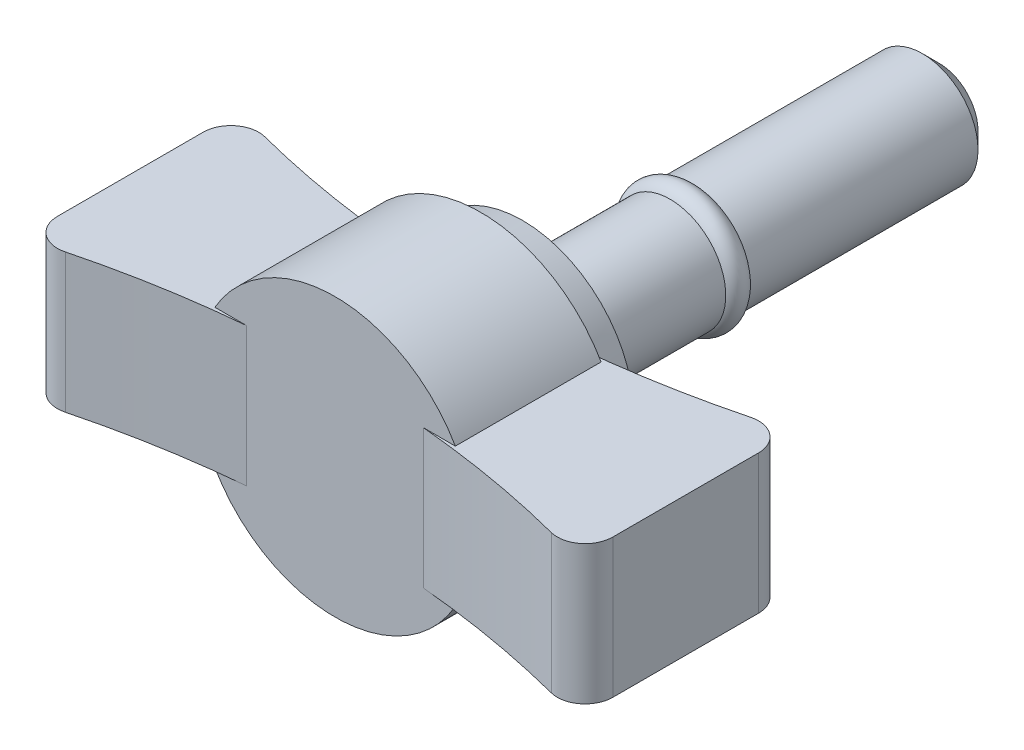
ISO-10303-21;
HEADER;
FILE_DESCRIPTION(('STEP AP214'),'2;1');
FILE_NAME('part.step','',(''),(''),'','','');
FILE_SCHEMA(('AUTOMOTIVE_DESIGN { 1 0 10303 214 1 1 1 1 }'));
ENDSEC;
DATA;
#1=APPLICATION_CONTEXT('core data for automotive mechanical design processes');
#2=APPLICATION_PROTOCOL_DEFINITION('international standard','automotive_design',2000,#1);
#3=PRODUCT_CONTEXT('',#1,'mechanical');
#4=PRODUCT('Part','Part','',(#3));
#5=PRODUCT_RELATED_PRODUCT_CATEGORY('part','',(#4));
#6=PRODUCT_DEFINITION_FORMATION('','',#4);
#7=PRODUCT_DEFINITION_CONTEXT('part definition',#1,'design');
#8=PRODUCT_DEFINITION('design','',#6,#7);
#9=PRODUCT_DEFINITION_SHAPE('','',#8);
#10=(LENGTH_UNIT() NAMED_UNIT(*) SI_UNIT(.MILLI.,.METRE.));
#11=(NAMED_UNIT(*) PLANE_ANGLE_UNIT() SI_UNIT($,.RADIAN.));
#12=(NAMED_UNIT(*) SI_UNIT($,.STERADIAN.) SOLID_ANGLE_UNIT());
#13=UNCERTAINTY_MEASURE_WITH_UNIT(LENGTH_MEASURE(1.E-05),#10,'distance_accuracy_value','');
#14=(GEOMETRIC_REPRESENTATION_CONTEXT(3) GLOBAL_UNCERTAINTY_ASSIGNED_CONTEXT((#13)) GLOBAL_UNIT_ASSIGNED_CONTEXT((#10,
#11,#12)) REPRESENTATION_CONTEXT('',''));
#15=CARTESIAN_POINT('',(0.,0.,0.));
#16=DIRECTION('',(0.,0.,1.));
#17=DIRECTION('',(1.,0.,0.));
#18=AXIS2_PLACEMENT_3D('',#15,#16,#17);
#19=CARTESIAN_POINT('',(0.,0.,3.));
#20=DIRECTION('',(0.,0.,1.));
#21=DIRECTION('',(1.,0.,0.));
#22=AXIS2_PLACEMENT_3D('',#19,#20,#21);
#23=PLANE('',#22);
#24=DIRECTION('',(-1.,0.,0.));
#25=VECTOR('',#24,1.);
#26=CARTESIAN_POINT('',(0.,-5.,3.));
#27=LINE('',#26,#25);
#28=CARTESIAN_POINT('',(8.66025403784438,-5.,3.));
#29=VERTEX_POINT('',#28);
#30=CARTESIAN_POINT('',(6.84311506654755,-5.,3.));
#31=VERTEX_POINT('',#30);
#32=EDGE_CURVE('E220',#29,#31,#27,.T.);
#33=ORIENTED_EDGE('',*,*,#32,.F.);
#34=CARTESIAN_POINT('',(0.,0.,3.));
#35=DIRECTION('',(0.,0.,1.));
#36=DIRECTION('',(1.,0.,0.));
#37=AXIS2_PLACEMENT_3D('',#34,#35,#36);
#38=CIRCLE('',#37,10.);
#39=CARTESIAN_POINT('',(-8.66025403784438,-5.,3.));
#40=VERTEX_POINT('',#39);
#41=EDGE_CURVE('E272',#40,#29,#38,.T.);
#42=ORIENTED_EDGE('',*,*,#41,.F.);
#43=CARTESIAN_POINT('',(-6.84311506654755,-5.,3.));
#44=VERTEX_POINT('',#43);
#45=EDGE_CURVE('E217',#44,#40,#27,.T.);
#46=ORIENTED_EDGE('',*,*,#45,.F.);
#47=CARTESIAN_POINT('',(0.,0.,3.));
#48=DIRECTION('',(0.,0.,1.));
#49=DIRECTION('',(1.,0.,0.));
#50=AXIS2_PLACEMENT_3D('',#47,#48,#49);
#51=CIRCLE('',#50,8.47515332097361);
#52=EDGE_CURVE('E283',#44,#31,#51,.T.);
#53=ORIENTED_EDGE('',*,*,#52,.T.);
#54=EDGE_LOOP('',(#33,#42,#46,#53));
#55=FACE_BOUND('',#54,.T.);
#56=ADVANCED_FACE('F14',(#55),#23,.F.);
#57=CARTESIAN_POINT('',(0.,0.,13.5));
#58=DIRECTION('',(0.,0.,-1.));
#59=DIRECTION('',(-1.,0.,0.));
#60=AXIS2_PLACEMENT_3D('',#57,#58,#59);
#61=CYLINDRICAL_SURFACE('',#60,10.);
#62=DIRECTION('',(0.,0.,-1.));
#63=VECTOR('',#62,1.);
#64=CARTESIAN_POINT('',(8.66025403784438,-5.,13.5));
#65=LINE('',#64,#63);
#66=CARTESIAN_POINT('',(8.66025403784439,-5.,13.5));
#67=VERTEX_POINT('',#66);
#68=EDGE_CURVE('E228',#67,#29,#65,.T.);
#69=ORIENTED_EDGE('',*,*,#68,.F.);
#70=CARTESIAN_POINT('',(0.,0.,13.5));
#71=DIRECTION('',(0.,0.,1.));
#72=DIRECTION('',(1.,0.,0.));
#73=AXIS2_PLACEMENT_3D('',#70,#71,#72);
#74=CIRCLE('',#73,10.);
#75=CARTESIAN_POINT('',(-8.66025403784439,-5.,13.5));
#76=VERTEX_POINT('',#75);
#77=EDGE_CURVE('E276',#76,#67,#74,.T.);
#78=ORIENTED_EDGE('',*,*,#77,.F.);
#79=DIRECTION('',(0.,0.,-1.));
#80=VECTOR('',#79,1.);
#81=CARTESIAN_POINT('',(-8.66025403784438,-5.,13.5));
#82=LINE('',#81,#80);
#83=EDGE_CURVE('E37',#40,#76,#82,.F.);
#84=ORIENTED_EDGE('',*,*,#83,.F.);
#85=ORIENTED_EDGE('',*,*,#41,.T.);
#86=EDGE_LOOP('',(#69,#78,#84,#85));
#87=FACE_BOUND('',#86,.T.);
#88=ADVANCED_FACE('F348',(#87),#61,.T.);
#89=CARTESIAN_POINT('',(0.,0.,-50.));
#90=DIRECTION('',(0.,0.,-1.));
#91=DIRECTION('',(-1.,0.,0.));
#92=AXIS2_PLACEMENT_3D('',#89,#90,#91);
#93=CYLINDRICAL_SURFACE('',#92,4.);
#94=CARTESIAN_POINT('',(0.,0.,-10.6339745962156));
#95=DIRECTION('',(0.,0.,-1.));
#96=DIRECTION('',(-1.,0.,0.));
#97=AXIS2_PLACEMENT_3D('',#94,#95,#96);
#98=CIRCLE('',#97,4.);
#99=CARTESIAN_POINT('',(-4.,0.,-10.6339745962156));
#100=VERTEX_POINT('',#99);
#101=EDGE_CURVE('E293',#100,#100,#98,.T.);
#102=ORIENTED_EDGE('',*,*,#101,.F.);
#103=EDGE_LOOP('',(#102));
#104=FACE_BOUND('',#103,.T.);
#105=CARTESIAN_POINT('',(0.,0.,0.));
#106=DIRECTION('',(0.,0.,-1.));
#107=DIRECTION('',(-1.,0.,0.));
#108=AXIS2_PLACEMENT_3D('',#105,#106,#107);
#109=CIRCLE('',#108,4.);
#110=CARTESIAN_POINT('',(-4.,0.,0.));
#111=VERTEX_POINT('',#110);
#112=EDGE_CURVE('E287',#111,#111,#109,.T.);
#113=ORIENTED_EDGE('',*,*,#112,.T.);
#114=EDGE_LOOP('',(#113));
#115=FACE_BOUND('',#114,.T.);
#116=ADVANCED_FACE('F366',(#104,#115),#93,.T.);
#117=CARTESIAN_POINT('',(0.,0.,-11.5));
#118=DIRECTION('',(0.,0.,-1.));
#119=DIRECTION('',(-1.,0.,0.));
#120=AXIS2_PLACEMENT_3D('',#117,#118,#119);
#121=TOROIDAL_SURFACE('',#120,3.5,1.);
#122=CARTESIAN_POINT('',(0.,0.,-12.3660254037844));
#123=DIRECTION('',(0.,0.,-1.));
#124=DIRECTION('',(-1.,0.,0.));
#125=AXIS2_PLACEMENT_3D('',#122,#123,#124);
#126=CIRCLE('',#125,4.);
#127=CARTESIAN_POINT('',(-4.,0.,-12.3660254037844));
#128=VERTEX_POINT('',#127);
#129=EDGE_CURVE('E290',#128,#128,#126,.T.);
#130=ORIENTED_EDGE('',*,*,#129,.F.);
#131=EDGE_LOOP('',(#130));
#132=FACE_BOUND('',#131,.T.);
#133=ORIENTED_EDGE('',*,*,#101,.T.);
#134=EDGE_LOOP('',(#133));
#135=FACE_BOUND('',#134,.T.);
#136=ADVANCED_FACE('F528',(#132,#135),#121,.T.);
#137=CARTESIAN_POINT('',(0.,0.,-50.));
#138=DIRECTION('',(0.,0.,-1.));
#139=DIRECTION('',(-1.,0.,0.));
#140=AXIS2_PLACEMENT_3D('',#137,#138,#139);
#141=CYLINDRICAL_SURFACE('',#140,4.);
#142=CARTESIAN_POINT('',(0.,0.,-28.8));
#143=DIRECTION('',(0.,0.,1.));
#144=DIRECTION('',(1.,0.,0.));
#145=AXIS2_PLACEMENT_3D('',#142,#143,#144);
#146=CIRCLE('',#145,4.);
#147=CARTESIAN_POINT('',(4.,0.,-28.8));
#148=VERTEX_POINT('',#147);
#149=EDGE_CURVE('E9',#148,#148,#146,.T.);
#150=ORIENTED_EDGE('',*,*,#149,.T.);
#151=EDGE_LOOP('',(#150));
#152=FACE_BOUND('',#151,.T.);
#153=ORIENTED_EDGE('',*,*,#129,.T.);
#154=EDGE_LOOP('',(#153));
#155=FACE_BOUND('',#154,.T.);
#156=ADVANCED_FACE('F523',(#152,#155),#141,.T.);
#157=CARTESIAN_POINT('',(0.,4.,-30.));
#158=DIRECTION('',(0.,0.,1.));
#159=DIRECTION('',(1.,0.,0.));
#160=AXIS2_PLACEMENT_3D('',#157,#158,#159);
#161=PLANE('',#160);
#162=CARTESIAN_POINT('',(0.,0.,-30.));
#163=DIRECTION('',(0.,0.,1.));
#164=DIRECTION('',(1.,0.,0.));
#165=AXIS2_PLACEMENT_3D('',#162,#163,#164);
#166=CIRCLE('',#165,2.8);
#167=CARTESIAN_POINT('',(2.8,0.,-30.));
#168=VERTEX_POINT('',#167);
#169=EDGE_CURVE('E22',#168,#168,#166,.F.);
#170=ORIENTED_EDGE('',*,*,#169,.T.);
#171=EDGE_LOOP('',(#170));
#172=FACE_BOUND('',#171,.T.);
#173=ADVANCED_FACE('F356',(#172),#161,.F.);
#174=CARTESIAN_POINT('',(0.,0.,0.));
#175=DIRECTION('',(0.,0.,1.));
#176=DIRECTION('',(1.,0.,0.));
#177=AXIS2_PLACEMENT_3D('',#174,#175,#176);
#178=CONICAL_SURFACE('',#177,8.,0.15707963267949);
#179=CARTESIAN_POINT('',(6.84311506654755,5.,3.));
#180=VERTEX_POINT('',#179);
#181=CARTESIAN_POINT('',(-6.84311506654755,5.,3.));
#182=VERTEX_POINT('',#181);
#183=EDGE_CURVE('E284',#180,#182,#51,.T.);
#184=ORIENTED_EDGE('',*,*,#183,.F.);
#185=CARTESIAN_POINT('',(9.28427649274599,5.,16.0687266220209));
#186=CARTESIAN_POINT('',(9.07217813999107,5.,14.8899811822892));
#187=CARTESIAN_POINT('',(8.85859104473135,5.,13.7114999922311));
#188=CARTESIAN_POINT('',(8.42748538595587,5.,11.3552851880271));
#189=CARTESIAN_POINT('',(8.20996691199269,5.,10.1775515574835));
#190=CARTESIAN_POINT('',(7.77011027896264,5.,7.8234004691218));
#191=CARTESIAN_POINT('',(7.54777379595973,5.,6.64698269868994));
#192=CARTESIAN_POINT('',(7.09676435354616,5.,4.29531987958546));
#193=CARTESIAN_POINT('',(6.86809119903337,5.,3.12007486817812));
#194=CARTESIAN_POINT('',(6.51867177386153,5.,1.35821760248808));
#195=CARTESIAN_POINT('',(6.40110452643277,5.,0.770974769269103));
#196=CARTESIAN_POINT('',(6.16346432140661,5.,-0.403002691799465));
#197=CARTESIAN_POINT('',(6.04339137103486,5.,-0.989737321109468));
#198=CARTESIAN_POINT('',(5.80027977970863,5.,-2.16254654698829));
#199=CARTESIAN_POINT('',(5.67724136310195,5.,-2.74862118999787));
#200=CARTESIAN_POINT('',(5.42757378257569,5.,-3.92001365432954));
#201=CARTESIAN_POINT('',(5.3009445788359,5.,-4.5053314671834));
#202=CARTESIAN_POINT('',(5.04322480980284,5.,-5.67522333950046));
#203=CARTESIAN_POINT('',(4.91213253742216,5.,-6.25979702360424));
#204=CARTESIAN_POINT('',(4.64441099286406,5.,-7.42766304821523));
#205=CARTESIAN_POINT('',(4.50778189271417,5.,-8.01095542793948));
#206=CARTESIAN_POINT('',(4.29742601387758,5.,-8.88466997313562));
#207=CARTESIAN_POINT('',(4.2263958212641,5.,-9.17574168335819));
#208=CARTESIAN_POINT('',(4.0822473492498,5.,-9.75736577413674));
#209=CARTESIAN_POINT('',(4.00912908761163,5.,-10.0479181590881));
#210=CARTESIAN_POINT('',(3.86045802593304,5.,-10.6284331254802));
#211=CARTESIAN_POINT('',(3.78490497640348,5.,-10.9183956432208));
#212=CARTESIAN_POINT('',(3.6308945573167,5.,-11.4975565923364));
#213=CARTESIAN_POINT('',(3.55243710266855,5.,-11.7867550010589));
#214=CARTESIAN_POINT('',(3.47229117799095,5.,-12.0754906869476));
#215=B_SPLINE_CURVE_WITH_KNOTS('',3,(#185,#186,#187,#188,#189,#190,#191,#192,#193,#194,#195,
#196,#197,#198,#199,#200,#201,#202,#203,#204,#205,#206,#207,#208,#209,#210,#211,#212,#213,#214),
.UNSPECIFIED.,.F.,.F.,(4,2,2,2,2,2,2,2,2,2,2,2,2,2,4),(0.,3.59303091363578,7.18598008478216,
10.7776988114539,14.3695282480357,16.1662114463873,17.962889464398,19.7594319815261,
21.5559944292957,23.3532519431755,25.1504536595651,26.0492868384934,26.9481123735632,
27.8470303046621,28.7459745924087),.UNSPECIFIED.);
#216=CARTESIAN_POINT('',(6.83439694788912,5.,2.95556551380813));
#217=VERTEX_POINT('',#216);
#218=EDGE_CURVE('E265',#180,#217,#215,.T.);
#219=ORIENTED_EDGE('',*,*,#218,.T.);
#220=CARTESIAN_POINT('',(6.83425338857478,-5.0002,2.95557959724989));
#221=CARTESIAN_POINT('',(6.97424768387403,-4.80521408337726,2.94184231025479));
#222=CARTESIAN_POINT('',(7.10597211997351,-4.60427023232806,2.92849740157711));
#223=CARTESIAN_POINT('',(7.35206485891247,-4.19196485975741,2.90294843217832));
#224=CARTESIAN_POINT('',(7.4664339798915,-3.98060382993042,2.89074431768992));
#225=CARTESIAN_POINT('',(7.6769557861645,-3.54906096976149,2.86783789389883));
#226=CARTESIAN_POINT('',(7.77311834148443,-3.32888399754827,2.85713477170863));
#227=CARTESIAN_POINT('',(7.94664657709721,-2.88116921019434,2.83752653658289));
#228=CARTESIAN_POINT('',(8.02401249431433,-2.65363148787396,2.82862140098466));
#229=CARTESIAN_POINT('',(8.15943909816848,-2.1927089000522,2.81286102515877));
#230=CARTESIAN_POINT('',(8.21749172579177,-1.95932163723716,2.8060066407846));
#231=CARTESIAN_POINT('',(8.31384378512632,-1.48844527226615,2.79454919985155));
#232=CARTESIAN_POINT('',(8.35214282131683,-1.25095608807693,2.78994618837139));
#233=CARTESIAN_POINT('',(8.40871118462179,-0.773622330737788,2.78312476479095));
#234=CARTESIAN_POINT('',(8.42698485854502,-0.533778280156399,2.78090583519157));
#235=CARTESIAN_POINT('',(8.44338894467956,-0.0533965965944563,2.77891459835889));
#236=CARTESIAN_POINT('',(8.44151971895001,0.187141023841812,2.7791422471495));
#237=CARTESIAN_POINT('',(8.41765841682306,0.667062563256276,2.78203673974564));
#238=CARTESIAN_POINT('',(8.39567796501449,0.906447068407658,2.78470217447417));
#239=CARTESIAN_POINT('',(8.33176706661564,1.38249401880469,2.79239341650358));
#240=CARTESIAN_POINT('',(8.28983683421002,1.61915649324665,2.79741919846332));
#241=CARTESIAN_POINT('',(8.18631763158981,2.08806979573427,2.80968727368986));
#242=CARTESIAN_POINT('',(8.12473061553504,2.32032105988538,2.81692934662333));
#243=CARTESIAN_POINT('',(7.98236658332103,2.77869647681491,2.83341767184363));
#244=CARTESIAN_POINT('',(7.90159351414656,3.00482187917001,2.84266351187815));
#245=CARTESIAN_POINT('',(7.68426168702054,3.54095672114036,2.86706927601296));
#246=CARTESIAN_POINT('',(7.53841917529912,3.84724616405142,2.88309808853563));
#247=CARTESIAN_POINT('',(7.29350448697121,4.29158124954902,2.90904537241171));
#248=CARTESIAN_POINT('',(7.20756643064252,4.43709465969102,2.91800593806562));
#249=CARTESIAN_POINT('',(7.0272057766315,4.72277207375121,2.93643988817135));
#250=CARTESIAN_POINT('',(6.93278147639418,4.862934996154,2.94591337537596));
#251=CARTESIAN_POINT('',(6.83425338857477,5.0002,2.95557959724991));
#252=B_SPLINE_CURVE_WITH_KNOTS('',3,(#220,#221,#222,#223,#224,#225,#226,#227,#228,#229,#230,
#231,#232,#233,#234,#235,#236,#237,#238,#239,#240,#241,#242,#243,#244,#245,#246,#247,#248,#249,
#250,#251),.UNSPECIFIED.,.F.,.F.,(4,2,2,2,2,2,2,2,2,2,2,2,2,2,2,4),(0.,0.721068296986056,
1.4421025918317,2.1627448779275,2.88337808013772,3.60431161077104,4.32525957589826,
5.04605101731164,5.7668295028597,6.48719163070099,7.20754602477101,7.92782882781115,
8.64796358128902,9.66406670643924,10.1715171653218,10.679069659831),.UNSPECIFIED.);
#253=CARTESIAN_POINT('',(6.83439694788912,-5.,2.95556551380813));
#254=VERTEX_POINT('',#253);
#255=EDGE_CURVE('E313',#254,#217,#252,.T.);
#256=ORIENTED_EDGE('',*,*,#255,.F.);
#257=CARTESIAN_POINT('',(9.28427649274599,-5.,16.0687266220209));
#258=CARTESIAN_POINT('',(9.07217813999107,-5.,14.8899811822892));
#259=CARTESIAN_POINT('',(8.85859104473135,-5.,13.7114999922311));
#260=CARTESIAN_POINT('',(8.42748538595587,-5.,11.3552851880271));
#261=CARTESIAN_POINT('',(8.20996691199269,-5.,10.1775515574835));
#262=CARTESIAN_POINT('',(7.77011027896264,-5.,7.8234004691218));
#263=CARTESIAN_POINT('',(7.54777379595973,-5.,6.64698269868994));
#264=CARTESIAN_POINT('',(7.09676435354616,-5.,4.29531987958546));
#265=CARTESIAN_POINT('',(6.86809119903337,-5.,3.12007486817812));
#266=CARTESIAN_POINT('',(6.51867177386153,-5.,1.35821760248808));
#267=CARTESIAN_POINT('',(6.40110452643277,-5.,0.770974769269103));
#268=CARTESIAN_POINT('',(6.16346432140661,-5.,-0.403002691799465));
#269=CARTESIAN_POINT('',(6.04339137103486,-5.,-0.989737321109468));
#270=CARTESIAN_POINT('',(5.80027977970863,-5.,-2.16254654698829));
#271=CARTESIAN_POINT('',(5.67724136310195,-5.,-2.74862118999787));
#272=CARTESIAN_POINT('',(5.42757378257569,-5.,-3.92001365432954));
#273=CARTESIAN_POINT('',(5.3009445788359,-5.,-4.5053314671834));
#274=CARTESIAN_POINT('',(5.04322480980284,-5.,-5.67522333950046));
#275=CARTESIAN_POINT('',(4.91213253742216,-5.,-6.25979702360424));
#276=CARTESIAN_POINT('',(4.64441099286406,-5.,-7.42766304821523));
#277=CARTESIAN_POINT('',(4.50778189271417,-5.,-8.01095542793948));
#278=CARTESIAN_POINT('',(4.29742601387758,-5.,-8.88466997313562));
#279=CARTESIAN_POINT('',(4.2263958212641,-5.,-9.17574168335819));
#280=CARTESIAN_POINT('',(4.0822473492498,-5.,-9.75736577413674));
#281=CARTESIAN_POINT('',(4.00912908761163,-5.,-10.0479181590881));
#282=CARTESIAN_POINT('',(3.86045802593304,-5.,-10.6284331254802));
#283=CARTESIAN_POINT('',(3.78490497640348,-5.,-10.9183956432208));
#284=CARTESIAN_POINT('',(3.6308945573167,-5.,-11.4975565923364));
#285=CARTESIAN_POINT('',(3.55243710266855,-5.,-11.7867550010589));
#286=CARTESIAN_POINT('',(3.47229117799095,-5.,-12.0754906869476));
#287=B_SPLINE_CURVE_WITH_KNOTS('',3,(#257,#258,#259,#260,#261,#262,#263,#264,#265,#266,#267,
#268,#269,#270,#271,#272,#273,#274,#275,#276,#277,#278,#279,#280,#281,#282,#283,#284,#285,#286),
.UNSPECIFIED.,.F.,.F.,(4,2,2,2,2,2,2,2,2,2,2,2,2,2,4),(0.,3.59303091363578,7.18598008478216,
10.7776988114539,14.3695282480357,16.1662114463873,17.962889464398,19.7594319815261,
21.5559944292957,23.3532519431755,25.1504536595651,26.0492868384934,26.9481123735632,
27.8470303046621,28.7459745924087),.UNSPECIFIED.);
#288=EDGE_CURVE('E242',#31,#254,#287,.T.);
#289=ORIENTED_EDGE('',*,*,#288,.F.);
#290=ORIENTED_EDGE('',*,*,#52,.F.);
#291=CARTESIAN_POINT('',(-3.47229117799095,-5.,-12.0754906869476));
#292=CARTESIAN_POINT('',(-3.53104571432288,-5.,-11.8638661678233));
#293=CARTESIAN_POINT('',(-3.58887993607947,-5.,-11.6519885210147));
#294=CARTESIAN_POINT('',(-3.70291514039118,-5.,-11.2277972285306));
#295=CARTESIAN_POINT('',(-3.75911614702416,-5.,-11.0154835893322));
#296=CARTESIAN_POINT('',(-3.92557601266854,-5.,-10.3780113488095));
#297=CARTESIAN_POINT('',(-4.03369903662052,-5.,-9.9522948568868));
#298=CARTESIAN_POINT('',(-4.24541884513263,-5.,-9.09981833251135));
#299=CARTESIAN_POINT('',(-4.34901637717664,-5.,-8.67305848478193));
#300=CARTESIAN_POINT('',(-4.55254001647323,-5.,-7.81865802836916));
#301=CARTESIAN_POINT('',(-4.65246605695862,-5.,-7.39101740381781));
#302=CARTESIAN_POINT('',(-4.94764678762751,-5.,-6.10734266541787));
#303=CARTESIAN_POINT('',(-5.13837449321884,-5.,-5.25026814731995));
#304=CARTESIAN_POINT('',(-5.51119561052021,-5.,-3.53422122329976));
#305=CARTESIAN_POINT('',(-5.69328867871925,-5.,-2.67524874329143));
#306=CARTESIAN_POINT('',(-5.93724493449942,-5.,-1.50248309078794));
#307=CARTESIAN_POINT('',(-6.00194478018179,-5.,-1.18927720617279));
#308=CARTESIAN_POINT('',(-6.13054951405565,-5.,-0.562706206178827));
#309=CARTESIAN_POINT('',(-6.19445441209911,-5.,-0.249341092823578));
#310=CARTESIAN_POINT('',(-6.38509219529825,-5.,0.691013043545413));
#311=CARTESIAN_POINT('',(-6.51074011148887,-5.,1.31822203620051));
#312=CARTESIAN_POINT('',(-6.86815125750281,-5.,3.12038182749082));
#313=CARTESIAN_POINT('',(-7.09688354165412,-5.,4.29593345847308));
#314=CARTESIAN_POINT('',(-7.54801634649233,-5.,6.64825526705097));
#315=CARTESIAN_POINT('',(-7.77041682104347,-5.,7.8250254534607));
#316=CARTESIAN_POINT('',(-8.21027653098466,-5.,10.1792244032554));
#317=CARTESIAN_POINT('',(-8.42773682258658,-5.,11.3566529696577));
#318=CARTESIAN_POINT('',(-8.85871952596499,-5.,13.7122085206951));
#319=CARTESIAN_POINT('',(-9.07224201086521,-5.,14.890335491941));
#320=CARTESIAN_POINT('',(-9.28427649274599,-5.,16.0687266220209));
#321=B_SPLINE_CURVE_WITH_KNOTS('',3,(#291,#292,#293,#294,#295,#296,#297,#298,#299,#300,#301,
#302,#303,#304,#305,#306,#307,#308,#309,#310,#311,#312,#313,#314,#315,#316,#317,#318,#319,#320),
.UNSPECIFIED.,.F.,.F.,(4,2,2,2,2,2,2,2,2,2,2,2,2,2,4),(0.,0.658882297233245,1.31775487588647,
2.63541736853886,3.95286139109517,5.27032935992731,7.90437728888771,10.5385299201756,
11.4979853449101,12.4574288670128,14.3764348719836,17.9692017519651,21.5619948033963,
25.154012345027,28.7459631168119),.UNSPECIFIED.);
#322=CARTESIAN_POINT('',(-6.83439694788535,-5.,2.95556551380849));
#323=VERTEX_POINT('',#322);
#324=EDGE_CURVE('E219',#323,#44,#321,.T.);
#325=ORIENTED_EDGE('',*,*,#324,.F.);
#326=CARTESIAN_POINT('',(-6.83425338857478,5.0002,2.95557959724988));
#327=CARTESIAN_POINT('',(-6.97424768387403,4.80521408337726,2.94184231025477));
#328=CARTESIAN_POINT('',(-7.1059721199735,4.60427023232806,2.92849740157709));
#329=CARTESIAN_POINT('',(-7.35206485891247,4.19196485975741,2.9029484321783));
#330=CARTESIAN_POINT('',(-7.46643397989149,3.98060382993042,2.89074431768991));
#331=CARTESIAN_POINT('',(-7.6769557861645,3.54906096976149,2.86783789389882));
#332=CARTESIAN_POINT('',(-7.77311834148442,3.32888399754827,2.85713477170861));
#333=CARTESIAN_POINT('',(-7.9466465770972,2.88116921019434,2.83752653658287));
#334=CARTESIAN_POINT('',(-8.02401249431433,2.65363148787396,2.82862140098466));
#335=CARTESIAN_POINT('',(-8.15943909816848,2.1927089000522,2.81286102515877));
#336=CARTESIAN_POINT('',(-8.21749172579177,1.95932163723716,2.80600664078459));
#337=CARTESIAN_POINT('',(-8.31384378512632,1.48844527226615,2.79454919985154));
#338=CARTESIAN_POINT('',(-8.35214282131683,1.25095608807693,2.78994618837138));
#339=CARTESIAN_POINT('',(-8.40871118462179,0.773622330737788,2.78312476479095));
#340=CARTESIAN_POINT('',(-8.42698485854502,0.5337782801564,2.78090583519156));
#341=CARTESIAN_POINT('',(-8.44338894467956,0.0533965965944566,2.77891459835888));
#342=CARTESIAN_POINT('',(-8.44151971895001,-0.187141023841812,2.77914224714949));
#343=CARTESIAN_POINT('',(-8.41765841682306,-0.667062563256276,2.78203673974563));
#344=CARTESIAN_POINT('',(-8.39567796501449,-0.906447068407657,2.78470217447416));
#345=CARTESIAN_POINT('',(-8.33176706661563,-1.38249401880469,2.79239341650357));
#346=CARTESIAN_POINT('',(-8.28983683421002,-1.61915649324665,2.79741919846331));
#347=CARTESIAN_POINT('',(-8.1863176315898,-2.08806979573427,2.80968727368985));
#348=CARTESIAN_POINT('',(-8.12473061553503,-2.32032105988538,2.81692934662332));
#349=CARTESIAN_POINT('',(-7.98236658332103,-2.77869647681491,2.83341767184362));
#350=CARTESIAN_POINT('',(-7.90159351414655,-3.00482187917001,2.84266351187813));
#351=CARTESIAN_POINT('',(-7.68426168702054,-3.54095672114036,2.86706927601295));
#352=CARTESIAN_POINT('',(-7.53841917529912,-3.84724616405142,2.88309808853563));
#353=CARTESIAN_POINT('',(-7.29350448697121,-4.29158124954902,2.9090453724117));
#354=CARTESIAN_POINT('',(-7.20756643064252,-4.43709465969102,2.9180059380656));
#355=CARTESIAN_POINT('',(-7.0272057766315,-4.72277207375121,2.93643988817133));
#356=CARTESIAN_POINT('',(-6.93278147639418,-4.862934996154,2.94591337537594));
#357=CARTESIAN_POINT('',(-6.83425338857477,-5.0002,2.95557959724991));
#358=B_SPLINE_CURVE_WITH_KNOTS('',3,(#326,#327,#328,#329,#330,#331,#332,#333,#334,#335,#336,
#337,#338,#339,#340,#341,#342,#343,#344,#345,#346,#347,#348,#349,#350,#351,#352,#353,#354,#355,
#356,#357),.UNSPECIFIED.,.F.,.F.,(4,2,2,2,2,2,2,2,2,2,2,2,2,2,2,4),(0.,0.721068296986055,
1.44210259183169,2.1627448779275,2.88337808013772,3.60431161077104,4.32525957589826,
5.04605101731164,5.7668295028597,6.48719163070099,7.207546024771,7.92782882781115,
8.64796358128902,9.66406670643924,10.1715171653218,10.679069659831),.UNSPECIFIED.);
#359=CARTESIAN_POINT('',(-6.83439694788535,5.,2.95556551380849));
#360=VERTEX_POINT('',#359);
#361=EDGE_CURVE('E306',#360,#323,#358,.T.);
#362=ORIENTED_EDGE('',*,*,#361,.F.);
#363=CARTESIAN_POINT('',(-3.47229117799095,5.,-12.0754906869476));
#364=CARTESIAN_POINT('',(-3.53104571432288,5.,-11.8638661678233));
#365=CARTESIAN_POINT('',(-3.58887993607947,5.,-11.6519885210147));
#366=CARTESIAN_POINT('',(-3.70291514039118,5.,-11.2277972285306));
#367=CARTESIAN_POINT('',(-3.75911614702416,5.,-11.0154835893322));
#368=CARTESIAN_POINT('',(-3.92557601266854,5.,-10.3780113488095));
#369=CARTESIAN_POINT('',(-4.03369903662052,5.,-9.9522948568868));
#370=CARTESIAN_POINT('',(-4.24541884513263,5.,-9.09981833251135));
#371=CARTESIAN_POINT('',(-4.34901637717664,5.,-8.67305848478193));
#372=CARTESIAN_POINT('',(-4.55254001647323,5.,-7.81865802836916));
#373=CARTESIAN_POINT('',(-4.65246605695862,5.,-7.39101740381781));
#374=CARTESIAN_POINT('',(-4.94764678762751,5.,-6.10734266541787));
#375=CARTESIAN_POINT('',(-5.13837449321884,5.,-5.25026814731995));
#376=CARTESIAN_POINT('',(-5.51119561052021,5.,-3.53422122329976));
#377=CARTESIAN_POINT('',(-5.69328867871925,5.,-2.67524874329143));
#378=CARTESIAN_POINT('',(-5.93724493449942,5.,-1.50248309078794));
#379=CARTESIAN_POINT('',(-6.00194478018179,5.,-1.18927720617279));
#380=CARTESIAN_POINT('',(-6.13054951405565,5.,-0.562706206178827));
#381=CARTESIAN_POINT('',(-6.19445441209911,5.,-0.249341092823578));
#382=CARTESIAN_POINT('',(-6.38509219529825,5.,0.691013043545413));
#383=CARTESIAN_POINT('',(-6.51074011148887,5.,1.31822203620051));
#384=CARTESIAN_POINT('',(-6.86815125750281,5.,3.12038182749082));
#385=CARTESIAN_POINT('',(-7.09688354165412,5.,4.29593345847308));
#386=CARTESIAN_POINT('',(-7.54801634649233,5.,6.64825526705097));
#387=CARTESIAN_POINT('',(-7.77041682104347,5.,7.8250254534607));
#388=CARTESIAN_POINT('',(-8.21027653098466,5.,10.1792244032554));
#389=CARTESIAN_POINT('',(-8.42773682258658,5.,11.3566529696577));
#390=CARTESIAN_POINT('',(-8.85871952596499,5.,13.7122085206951));
#391=CARTESIAN_POINT('',(-9.07224201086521,5.,14.890335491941));
#392=CARTESIAN_POINT('',(-9.28427649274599,5.,16.0687266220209));
#393=B_SPLINE_CURVE_WITH_KNOTS('',3,(#363,#364,#365,#366,#367,#368,#369,#370,#371,#372,#373,
#374,#375,#376,#377,#378,#379,#380,#381,#382,#383,#384,#385,#386,#387,#388,#389,#390,#391,#392),
.UNSPECIFIED.,.F.,.F.,(4,2,2,2,2,2,2,2,2,2,2,2,2,2,4),(0.,0.658882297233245,1.31775487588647,
2.63541736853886,3.95286139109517,5.27032935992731,7.90437728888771,10.5385299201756,
11.4979853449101,12.4574288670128,14.3764348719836,17.9692017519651,21.5619948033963,
25.154012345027,28.7459631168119),.UNSPECIFIED.);
#394=EDGE_CURVE('E254',#360,#182,#393,.T.);
#395=ORIENTED_EDGE('',*,*,#394,.T.);
#396=EDGE_LOOP('',(#184,#219,#256,#289,#290,#325,#362,#395));
#397=FACE_BOUND('',#396,.T.);
#398=CARTESIAN_POINT('',(0.,0.,0.));
#399=DIRECTION('',(0.,0.,1.));
#400=DIRECTION('',(1.,0.,0.));
#401=AXIS2_PLACEMENT_3D('',#398,#399,#400);
#402=CIRCLE('',#401,8.);
#403=CARTESIAN_POINT('',(8.,0.,0.));
#404=VERTEX_POINT('',#403);
#405=EDGE_CURVE('E280',#404,#404,#402,.T.);
#406=ORIENTED_EDGE('',*,*,#405,.T.);
#407=EDGE_LOOP('',(#406));
#408=FACE_BOUND('',#407,.T.);
#409=ADVANCED_FACE('F230',(#397,#408),#178,.T.);
#410=CARTESIAN_POINT('',(0.,0.,0.));
#411=DIRECTION('',(0.,0.,1.));
#412=DIRECTION('',(1.,0.,0.));
#413=AXIS2_PLACEMENT_3D('',#410,#411,#412);
#414=PLANE('',#413);
#415=ORIENTED_EDGE('',*,*,#112,.F.);
#416=EDGE_LOOP('',(#415));
#417=FACE_BOUND('',#416,.T.);
#418=ORIENTED_EDGE('',*,*,#405,.F.);
#419=EDGE_LOOP('',(#418));
#420=FACE_BOUND('',#419,.T.);
#421=ADVANCED_FACE('F340',(#417,#420),#414,.F.);
#422=CARTESIAN_POINT('',(8.66025403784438,5.,3.));
#423=VERTEX_POINT('',#422);
#424=CARTESIAN_POINT('',(-8.66025403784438,5.,3.));
#425=VERTEX_POINT('',#424);
#426=EDGE_CURVE('E273',#423,#425,#38,.T.);
#427=ORIENTED_EDGE('',*,*,#426,.F.);
#428=DIRECTION('',(-1.,0.,0.));
#429=VECTOR('',#428,1.);
#430=CARTESIAN_POINT('',(0.,5.,3.));
#431=LINE('',#430,#429);
#432=EDGE_CURVE('E255',#423,#180,#431,.T.);
#433=ORIENTED_EDGE('',*,*,#432,.T.);
#434=ORIENTED_EDGE('',*,*,#183,.T.);
#435=EDGE_CURVE('E251',#182,#425,#431,.T.);
#436=ORIENTED_EDGE('',*,*,#435,.T.);
#437=EDGE_LOOP('',(#427,#433,#434,#436));
#438=FACE_BOUND('',#437,.T.);
#439=ADVANCED_FACE('F336',(#438),#23,.F.);
#440=CARTESIAN_POINT('',(8.66025403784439,5.,13.5));
#441=VERTEX_POINT('',#440);
#442=CARTESIAN_POINT('',(-8.66025403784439,5.,13.5));
#443=VERTEX_POINT('',#442);
#444=EDGE_CURVE('E277',#441,#443,#74,.T.);
#445=ORIENTED_EDGE('',*,*,#444,.F.);
#446=DIRECTION('',(0.,0.,-1.));
#447=VECTOR('',#446,1.);
#448=CARTESIAN_POINT('',(8.66025403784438,5.,13.5));
#449=LINE('',#448,#447);
#450=EDGE_CURVE('E262',#441,#423,#449,.T.);
#451=ORIENTED_EDGE('',*,*,#450,.T.);
#452=ORIENTED_EDGE('',*,*,#426,.T.);
#453=DIRECTION('',(0.,0.,-1.));
#454=VECTOR('',#453,1.);
#455=CARTESIAN_POINT('',(-8.66025403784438,5.,13.5));
#456=LINE('',#455,#454);
#457=EDGE_CURVE('E248',#425,#443,#456,.F.);
#458=ORIENTED_EDGE('',*,*,#457,.T.);
#459=EDGE_LOOP('',(#445,#451,#452,#458));
#460=FACE_BOUND('',#459,.T.);
#461=ADVANCED_FACE('F339',(#460),#61,.T.);
#462=CARTESIAN_POINT('',(0.,0.,13.5));
#463=DIRECTION('',(0.,0.,1.));
#464=DIRECTION('',(1.,0.,0.));
#465=AXIS2_PLACEMENT_3D('',#462,#463,#464);
#466=PLANE('',#465);
#467=DIRECTION('',(-1.,0.,0.));
#468=VECTOR('',#467,1.);
#469=CARTESIAN_POINT('',(0.,5.,13.5));
#470=LINE('',#469,#468);
#471=CARTESIAN_POINT('',(6.3652101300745,5.,13.5));
#472=VERTEX_POINT('',#471);
#473=EDGE_CURVE('E303',#441,#472,#470,.T.);
#474=ORIENTED_EDGE('',*,*,#473,.F.);
#475=ORIENTED_EDGE('',*,*,#444,.T.);
#476=CARTESIAN_POINT('',(-6.3652101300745,5.,13.5));
#477=VERTEX_POINT('',#476);
#478=EDGE_CURVE('E301',#477,#443,#470,.T.);
#479=ORIENTED_EDGE('',*,*,#478,.F.);
#480=DIRECTION('',(0.,-1.,0.));
#481=VECTOR('',#480,1.);
#482=CARTESIAN_POINT('',(-6.3652101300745,5.,13.5));
#483=LINE('',#482,#481);
#484=CARTESIAN_POINT('',(-6.3652101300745,-5.,13.5));
#485=VERTEX_POINT('',#484);
#486=EDGE_CURVE('E298',#485,#477,#483,.F.);
#487=ORIENTED_EDGE('',*,*,#486,.F.);
#488=DIRECTION('',(-1.,0.,0.));
#489=VECTOR('',#488,1.);
#490=CARTESIAN_POINT('',(0.,-5.,13.5));
#491=LINE('',#490,#489);
#492=EDGE_CURVE('E296',#485,#76,#491,.T.);
#493=ORIENTED_EDGE('',*,*,#492,.T.);
#494=ORIENTED_EDGE('',*,*,#77,.T.);
#495=CARTESIAN_POINT('',(6.3652101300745,-5.,13.5));
#496=VERTEX_POINT('',#495);
#497=EDGE_CURVE('E299',#67,#496,#491,.T.);
#498=ORIENTED_EDGE('',*,*,#497,.T.);
#499=DIRECTION('',(0.,-1.,0.));
#500=VECTOR('',#499,1.);
#501=CARTESIAN_POINT('',(6.3652101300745,5.,13.5));
#502=LINE('',#501,#500);
#503=EDGE_CURVE('E304',#472,#496,#502,.T.);
#504=ORIENTED_EDGE('',*,*,#503,.F.);
#505=EDGE_LOOP('',(#474,#475,#479,#487,#493,#494,#498,#504));
#506=FACE_BOUND('',#505,.T.);
#507=ADVANCED_FACE('F342',(#506),#466,.T.);
#508=CARTESIAN_POINT('',(-18.,5.,3.00370023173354));
#509=DIRECTION('',(0.,-1.,0.));
#510=DIRECTION('',(1.,0.,0.));
#511=AXIS2_PLACEMENT_3D('',#508,#509,#510);
#512=CYLINDRICAL_SURFACE('',#511,2.);
#513=DIRECTION('',(0.,-1.,0.));
#514=VECTOR('',#513,1.);
#515=CARTESIAN_POINT('',(-20.,5.,3.00370023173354));
#516=LINE('',#515,#514);
#517=CARTESIAN_POINT('',(-20.,5.,3.00370023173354));
#518=VERTEX_POINT('',#517);
#519=CARTESIAN_POINT('',(-20.,-5.,3.00370023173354));
#520=VERTEX_POINT('',#519);
#521=EDGE_CURVE('E208',#518,#520,#516,.T.);
#522=ORIENTED_EDGE('',*,*,#521,.F.);
#523=CARTESIAN_POINT('',(-18.,5.,3.00370023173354));
#524=DIRECTION('',(0.,1.,0.));
#525=DIRECTION('',(-1.,0.,0.));
#526=AXIS2_PLACEMENT_3D('',#523,#524,#525);
#527=CIRCLE('',#526,2.);
#528=CARTESIAN_POINT('',(-17.5,5.,1.06720855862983));
#529=VERTEX_POINT('',#528);
#530=EDGE_CURVE('E189',#529,#518,#527,.T.);
#531=ORIENTED_EDGE('',*,*,#530,.F.);
#532=DIRECTION('',(0.,-1.,0.));
#533=VECTOR('',#532,1.);
#534=CARTESIAN_POINT('',(-17.5,5.,1.06720855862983));
#535=LINE('',#534,#533);
#536=CARTESIAN_POINT('',(-17.5,-5.,1.06720855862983));
#537=VERTEX_POINT('',#536);
#538=EDGE_CURVE('E210',#529,#537,#535,.T.);
#539=ORIENTED_EDGE('',*,*,#538,.T.);
#540=CARTESIAN_POINT('',(-18.,-5.,3.00370023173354));
#541=DIRECTION('',(0.,1.,0.));
#542=DIRECTION('',(-1.,0.,0.));
#543=AXIS2_PLACEMENT_3D('',#540,#541,#542);
#544=CIRCLE('',#543,2.);
#545=EDGE_CURVE('E168',#537,#520,#544,.T.);
#546=ORIENTED_EDGE('',*,*,#545,.T.);
#547=EDGE_LOOP('',(#522,#531,#539,#546));
#548=FACE_BOUND('',#547,.T.);
#549=ADVANCED_FACE('F326',(#548),#512,.T.);
#550=CARTESIAN_POINT('',(-20.,5.,3.00370023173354));
#551=DIRECTION('',(1.,0.,0.));
#552=DIRECTION('',(0.,0.,-1.));
#553=AXIS2_PLACEMENT_3D('',#550,#551,#552);
#554=PLANE('',#553);
#555=DIRECTION('',(0.,-1.,0.));
#556=VECTOR('',#555,1.);
#557=CARTESIAN_POINT('',(-20.,5.,13.4962997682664));
#558=LINE('',#557,#556);
#559=CARTESIAN_POINT('',(-20.,5.,13.4962997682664));
#560=VERTEX_POINT('',#559);
#561=CARTESIAN_POINT('',(-20.,-5.,13.4962997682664));
#562=VERTEX_POINT('',#561);
#563=EDGE_CURVE('E206',#560,#562,#558,.T.);
#564=ORIENTED_EDGE('',*,*,#563,.F.);
#565=DIRECTION('',(0.,0.,1.));
#566=VECTOR('',#565,1.);
#567=CARTESIAN_POINT('',(-20.,5.,3.00370023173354));
#568=LINE('',#567,#566);
#569=EDGE_CURVE('E192',#518,#560,#568,.T.);
#570=ORIENTED_EDGE('',*,*,#569,.F.);
#571=ORIENTED_EDGE('',*,*,#521,.T.);
#572=DIRECTION('',(0.,0.,1.));
#573=VECTOR('',#572,1.);
#574=CARTESIAN_POINT('',(-20.,-5.,3.00370023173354));
#575=LINE('',#574,#573);
#576=EDGE_CURVE('E171',#520,#562,#575,.T.);
#577=ORIENTED_EDGE('',*,*,#576,.T.);
#578=EDGE_LOOP('',(#564,#570,#571,#577));
#579=FACE_BOUND('',#578,.T.);
#580=ADVANCED_FACE('F395',(#579),#554,.F.);
#581=CARTESIAN_POINT('',(-18.,5.,13.4962997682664));
#582=DIRECTION('',(0.,-1.,0.));
#583=DIRECTION('',(1.,0.,0.));
#584=AXIS2_PLACEMENT_3D('',#581,#582,#583);
#585=CYLINDRICAL_SURFACE('',#584,2.);
#586=DIRECTION('',(0.,-1.,0.));
#587=VECTOR('',#586,1.);
#588=CARTESIAN_POINT('',(-17.5,5.,15.4327914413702));
#589=LINE('',#588,#587);
#590=CARTESIAN_POINT('',(-17.5,5.,15.4327914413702));
#591=VERTEX_POINT('',#590);
#592=CARTESIAN_POINT('',(-17.5,-5.,15.4327914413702));
#593=VERTEX_POINT('',#592);
#594=EDGE_CURVE('E203',#591,#593,#589,.T.);
#595=ORIENTED_EDGE('',*,*,#594,.F.);
#596=CARTESIAN_POINT('',(-18.,5.,13.4962997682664));
#597=DIRECTION('',(0.,-1.,0.));
#598=DIRECTION('',(1.,0.,0.));
#599=AXIS2_PLACEMENT_3D('',#596,#597,#598);
#600=CIRCLE('',#599,2.);
#601=EDGE_CURVE('E195',#591,#560,#600,.T.);
#602=ORIENTED_EDGE('',*,*,#601,.T.);
#603=ORIENTED_EDGE('',*,*,#563,.T.);
#604=CARTESIAN_POINT('',(-18.,-5.,13.4962997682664));
#605=DIRECTION('',(0.,-1.,0.));
#606=DIRECTION('',(1.,0.,0.));
#607=AXIS2_PLACEMENT_3D('',#604,#605,#606);
#608=CIRCLE('',#607,2.);
#609=EDGE_CURVE('E174',#593,#562,#608,.T.);
#610=ORIENTED_EDGE('',*,*,#609,.F.);
#611=EDGE_LOOP('',(#595,#602,#603,#610));
#612=FACE_BOUND('',#611,.T.);
#613=ADVANCED_FACE('F391',(#612),#585,.T.);
#614=CARTESIAN_POINT('',(18.,5.,13.4962997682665));
#615=DIRECTION('',(0.,1.,0.));
#616=DIRECTION('',(-1.,0.,0.));
#617=AXIS2_PLACEMENT_3D('',#614,#615,#616);
#618=PLANE('',#617);
#619=ORIENTED_EDGE('',*,*,#394,.F.);
#620=CARTESIAN_POINT('',(0.,5.,-66.71));
#621=DIRECTION('',(0.,-1.,0.));
#622=DIRECTION('',(1.,0.,0.));
#623=AXIS2_PLACEMENT_3D('',#620,#621,#622);
#624=CIRCLE('',#623,70.);
#625=EDGE_CURVE('E185',#360,#529,#624,.T.);
#626=ORIENTED_EDGE('',*,*,#625,.T.);
#627=ORIENTED_EDGE('',*,*,#530,.T.);
#628=ORIENTED_EDGE('',*,*,#569,.T.);
#629=ORIENTED_EDGE('',*,*,#601,.F.);
#630=CARTESIAN_POINT('',(0.,5.,83.21));
#631=DIRECTION('',(0.,1.,0.));
#632=DIRECTION('',(-1.,0.,0.));
#633=AXIS2_PLACEMENT_3D('',#630,#631,#632);
#634=CIRCLE('',#633,70.);
#635=EDGE_CURVE('E198',#477,#591,#634,.T.);
#636=ORIENTED_EDGE('',*,*,#635,.F.);
#637=ORIENTED_EDGE('',*,*,#478,.T.);
#638=ORIENTED_EDGE('',*,*,#457,.F.);
#639=ORIENTED_EDGE('',*,*,#435,.F.);
#640=EDGE_LOOP('',(#619,#626,#627,#628,#629,#636,#637,#638,#639));
#641=FACE_BOUND('',#640,.T.);
#642=ADVANCED_FACE('F415',(#641),#618,.T.);
#643=CARTESIAN_POINT('',(18.,-5.,13.4962997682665));
#644=DIRECTION('',(0.,1.,0.));
#645=DIRECTION('',(-1.,0.,0.));
#646=AXIS2_PLACEMENT_3D('',#643,#644,#645);
#647=PLANE('',#646);
#648=CARTESIAN_POINT('',(0.,-5.,-66.71));
#649=DIRECTION('',(0.,-1.,0.));
#650=DIRECTION('',(1.,0.,0.));
#651=AXIS2_PLACEMENT_3D('',#648,#649,#650);
#652=CIRCLE('',#651,70.);
#653=EDGE_CURVE('E162',#323,#537,#652,.T.);
#654=ORIENTED_EDGE('',*,*,#653,.F.);
#655=ORIENTED_EDGE('',*,*,#324,.T.);
#656=ORIENTED_EDGE('',*,*,#45,.T.);
#657=ORIENTED_EDGE('',*,*,#83,.T.);
#658=ORIENTED_EDGE('',*,*,#492,.F.);
#659=CARTESIAN_POINT('',(0.,-5.,83.21));
#660=DIRECTION('',(0.,1.,0.));
#661=DIRECTION('',(-1.,0.,0.));
#662=AXIS2_PLACEMENT_3D('',#659,#660,#661);
#663=CIRCLE('',#662,70.);
#664=EDGE_CURVE('E177',#485,#593,#663,.T.);
#665=ORIENTED_EDGE('',*,*,#664,.T.);
#666=ORIENTED_EDGE('',*,*,#609,.T.);
#667=ORIENTED_EDGE('',*,*,#576,.F.);
#668=ORIENTED_EDGE('',*,*,#545,.F.);
#669=EDGE_LOOP('',(#654,#655,#656,#657,#658,#665,#666,#667,#668));
#670=FACE_BOUND('',#669,.T.);
#671=ADVANCED_FACE('F238',(#670),#647,.F.);
#672=CARTESIAN_POINT('',(0.,5.,83.21));
#673=DIRECTION('',(0.,-1.,0.));
#674=DIRECTION('',(1.,0.,0.));
#675=AXIS2_PLACEMENT_3D('',#672,#673,#674);
#676=CYLINDRICAL_SURFACE('',#675,70.);
#677=ORIENTED_EDGE('',*,*,#664,.F.);
#678=ORIENTED_EDGE('',*,*,#486,.T.);
#679=ORIENTED_EDGE('',*,*,#635,.T.);
#680=ORIENTED_EDGE('',*,*,#594,.T.);
#681=EDGE_LOOP('',(#677,#678,#679,#680));
#682=FACE_BOUND('',#681,.T.);
#683=ADVANCED_FACE('F324',(#682),#676,.F.);
#684=CARTESIAN_POINT('',(0.,5.,-66.71));
#685=DIRECTION('',(0.,-1.,0.));
#686=DIRECTION('',(1.,0.,0.));
#687=AXIS2_PLACEMENT_3D('',#684,#685,#686);
#688=CYLINDRICAL_SURFACE('',#687,70.);
#689=ORIENTED_EDGE('',*,*,#625,.F.);
#690=ORIENTED_EDGE('',*,*,#361,.T.);
#691=ORIENTED_EDGE('',*,*,#653,.T.);
#692=ORIENTED_EDGE('',*,*,#538,.F.);
#693=EDGE_LOOP('',(#689,#690,#691,#692));
#694=FACE_BOUND('',#693,.T.);
#695=ADVANCED_FACE('F318',(#694),#688,.F.);
#696=CARTESIAN_POINT('',(17.5,-5.,1.06720855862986));
#697=VERTEX_POINT('',#696);
#698=EDGE_CURVE('E165',#697,#254,#652,.T.);
#699=ORIENTED_EDGE('',*,*,#698,.T.);
#700=ORIENTED_EDGE('',*,*,#255,.T.);
#701=CARTESIAN_POINT('',(17.5,5.,1.06720855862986));
#702=VERTEX_POINT('',#701);
#703=EDGE_CURVE('E186',#702,#217,#624,.T.);
#704=ORIENTED_EDGE('',*,*,#703,.F.);
#705=DIRECTION('',(0.,-1.,0.));
#706=VECTOR('',#705,1.);
#707=CARTESIAN_POINT('',(17.5,5.,1.06720855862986));
#708=LINE('',#707,#706);
#709=EDGE_CURVE('E213',#702,#697,#708,.T.);
#710=ORIENTED_EDGE('',*,*,#709,.T.);
#711=EDGE_LOOP('',(#699,#700,#704,#710));
#712=FACE_BOUND('',#711,.T.);
#713=ADVANCED_FACE('F323',(#712),#688,.F.);
#714=ORIENTED_EDGE('',*,*,#218,.F.);
#715=ORIENTED_EDGE('',*,*,#432,.F.);
#716=ORIENTED_EDGE('',*,*,#450,.F.);
#717=ORIENTED_EDGE('',*,*,#473,.T.);
#718=CARTESIAN_POINT('',(17.5,5.,15.4327914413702));
#719=VERTEX_POINT('',#718);
#720=EDGE_CURVE('E199',#719,#472,#634,.T.);
#721=ORIENTED_EDGE('',*,*,#720,.F.);
#722=CARTESIAN_POINT('',(18.,5.,13.4962997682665));
#723=DIRECTION('',(0.,1.,0.));
#724=DIRECTION('',(-1.,0.,0.));
#725=AXIS2_PLACEMENT_3D('',#722,#723,#724);
#726=CIRCLE('',#725,2.);
#727=CARTESIAN_POINT('',(20.,5.,13.4962997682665));
#728=VERTEX_POINT('',#727);
#729=EDGE_CURVE('E179',#719,#728,#726,.T.);
#730=ORIENTED_EDGE('',*,*,#729,.T.);
#731=DIRECTION('',(0.,0.,1.));
#732=VECTOR('',#731,1.);
#733=CARTESIAN_POINT('',(20.,5.,3.00370023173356));
#734=LINE('',#733,#732);
#735=CARTESIAN_POINT('',(20.,5.,3.00370023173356));
#736=VERTEX_POINT('',#735);
#737=EDGE_CURVE('E147',#736,#728,#734,.T.);
#738=ORIENTED_EDGE('',*,*,#737,.F.);
#739=CARTESIAN_POINT('',(18.,5.,3.00370023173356));
#740=DIRECTION('',(0.,-1.,0.));
#741=DIRECTION('',(1.,0.,0.));
#742=AXIS2_PLACEMENT_3D('',#739,#740,#741);
#743=CIRCLE('',#742,2.);
#744=EDGE_CURVE('E182',#702,#736,#743,.T.);
#745=ORIENTED_EDGE('',*,*,#744,.F.);
#746=ORIENTED_EDGE('',*,*,#703,.T.);
#747=EDGE_LOOP('',(#714,#715,#716,#717,#721,#730,#738,#745,#746));
#748=FACE_BOUND('',#747,.T.);
#749=ADVANCED_FACE('F237',(#748),#618,.T.);
#750=ORIENTED_EDGE('',*,*,#32,.T.);
#751=ORIENTED_EDGE('',*,*,#288,.T.);
#752=ORIENTED_EDGE('',*,*,#698,.F.);
#753=CARTESIAN_POINT('',(18.,-5.,3.00370023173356));
#754=DIRECTION('',(0.,-1.,0.));
#755=DIRECTION('',(1.,0.,0.));
#756=AXIS2_PLACEMENT_3D('',#753,#754,#755);
#757=CIRCLE('',#756,2.);
#758=CARTESIAN_POINT('',(20.,-5.,3.00370023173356));
#759=VERTEX_POINT('',#758);
#760=EDGE_CURVE('E160',#697,#759,#757,.T.);
#761=ORIENTED_EDGE('',*,*,#760,.T.);
#762=DIRECTION('',(0.,0.,1.));
#763=VECTOR('',#762,1.);
#764=CARTESIAN_POINT('',(20.,-5.,3.00370023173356));
#765=LINE('',#764,#763);
#766=CARTESIAN_POINT('',(20.,-5.,13.4962997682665));
#767=VERTEX_POINT('',#766);
#768=EDGE_CURVE('E144',#759,#767,#765,.T.);
#769=ORIENTED_EDGE('',*,*,#768,.T.);
#770=CARTESIAN_POINT('',(18.,-5.,13.4962997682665));
#771=DIRECTION('',(0.,1.,0.));
#772=DIRECTION('',(-1.,0.,0.));
#773=AXIS2_PLACEMENT_3D('',#770,#771,#772);
#774=CIRCLE('',#773,2.);
#775=CARTESIAN_POINT('',(17.5,-5.,15.4327914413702));
#776=VERTEX_POINT('',#775);
#777=EDGE_CURVE('E153',#776,#767,#774,.T.);
#778=ORIENTED_EDGE('',*,*,#777,.F.);
#779=EDGE_CURVE('E29',#776,#496,#663,.T.);
#780=ORIENTED_EDGE('',*,*,#779,.T.);
#781=ORIENTED_EDGE('',*,*,#497,.F.);
#782=ORIENTED_EDGE('',*,*,#68,.T.);
#783=EDGE_LOOP('',(#750,#751,#752,#761,#769,#778,#780,#781,#782));
#784=FACE_BOUND('',#783,.T.);
#785=ADVANCED_FACE('F157',(#784),#647,.F.);
#786=CARTESIAN_POINT('',(18.,5.,13.4962997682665));
#787=DIRECTION('',(0.,-1.,0.));
#788=DIRECTION('',(1.,0.,0.));
#789=AXIS2_PLACEMENT_3D('',#786,#787,#788);
#790=CYLINDRICAL_SURFACE('',#789,2.);
#791=DIRECTION('',(0.,-1.,0.));
#792=VECTOR('',#791,1.);
#793=CARTESIAN_POINT('',(20.,5.,13.4962997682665));
#794=LINE('',#793,#792);
#795=EDGE_CURVE('E140',#728,#767,#794,.T.);
#796=ORIENTED_EDGE('',*,*,#795,.F.);
#797=ORIENTED_EDGE('',*,*,#729,.F.);
#798=DIRECTION('',(0.,-1.,0.));
#799=VECTOR('',#798,1.);
#800=CARTESIAN_POINT('',(17.5,5.,15.4327914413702));
#801=LINE('',#800,#799);
#802=EDGE_CURVE('E155',#719,#776,#801,.T.);
#803=ORIENTED_EDGE('',*,*,#802,.T.);
#804=ORIENTED_EDGE('',*,*,#777,.T.);
#805=EDGE_LOOP('',(#796,#797,#803,#804));
#806=FACE_BOUND('',#805,.T.);
#807=ADVANCED_FACE('F154',(#806),#790,.T.);
#808=CARTESIAN_POINT('',(20.,5.,3.00370023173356));
#809=DIRECTION('',(1.,0.,0.));
#810=DIRECTION('',(0.,0.,-1.));
#811=AXIS2_PLACEMENT_3D('',#808,#809,#810);
#812=PLANE('',#811);
#813=DIRECTION('',(0.,-1.,0.));
#814=VECTOR('',#813,1.);
#815=CARTESIAN_POINT('',(20.,5.,3.00370023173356));
#816=LINE('',#815,#814);
#817=EDGE_CURVE('E151',#736,#759,#816,.T.);
#818=ORIENTED_EDGE('',*,*,#817,.F.);
#819=ORIENTED_EDGE('',*,*,#737,.T.);
#820=ORIENTED_EDGE('',*,*,#795,.T.);
#821=ORIENTED_EDGE('',*,*,#768,.F.);
#822=EDGE_LOOP('',(#818,#819,#820,#821));
#823=FACE_BOUND('',#822,.T.);
#824=ADVANCED_FACE('F142',(#823),#812,.T.);
#825=CARTESIAN_POINT('',(18.,5.,3.00370023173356));
#826=DIRECTION('',(0.,-1.,0.));
#827=DIRECTION('',(1.,0.,0.));
#828=AXIS2_PLACEMENT_3D('',#825,#826,#827);
#829=CYLINDRICAL_SURFACE('',#828,2.);
#830=ORIENTED_EDGE('',*,*,#709,.F.);
#831=ORIENTED_EDGE('',*,*,#744,.T.);
#832=ORIENTED_EDGE('',*,*,#817,.T.);
#833=ORIENTED_EDGE('',*,*,#760,.F.);
#834=EDGE_LOOP('',(#830,#831,#832,#833));
#835=FACE_BOUND('',#834,.T.);
#836=ADVANCED_FACE('F328',(#835),#829,.T.);
#837=ORIENTED_EDGE('',*,*,#720,.T.);
#838=ORIENTED_EDGE('',*,*,#503,.T.);
#839=ORIENTED_EDGE('',*,*,#779,.F.);
#840=ORIENTED_EDGE('',*,*,#802,.F.);
#841=EDGE_LOOP('',(#837,#838,#839,#840));
#842=FACE_BOUND('',#841,.T.);
#843=ADVANCED_FACE('F332',(#842),#676,.F.);
#844=CARTESIAN_POINT('',(0.,0.,-30.));
#845=DIRECTION('',(0.,0.,1.));
#846=DIRECTION('',(1.,0.,0.));
#847=AXIS2_PLACEMENT_3D('',#844,#845,#846);
#848=CONICAL_SURFACE('',#847,2.8,0.785398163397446);
#849=ORIENTED_EDGE('',*,*,#149,.F.);
#850=EDGE_LOOP('',(#849));
#851=FACE_BOUND('',#850,.T.);
#852=ORIENTED_EDGE('',*,*,#169,.F.);
#853=EDGE_LOOP('',(#852));
#854=FACE_BOUND('',#853,.T.);
#855=ADVANCED_FACE('F16',(#851,#854),#848,.T.);
#856=CLOSED_SHELL('',(#56,#88,#116,#136,#156,#173,#409,#421,#439,#461,#507,#549,#580,#613,#642,
#671,#683,#695,#713,#749,#785,#807,#824,#836,#843,#855));
#857=MANIFOLD_SOLID_BREP('B1',#856);
#858=ADVANCED_BREP_SHAPE_REPRESENTATION('',(#18,#857),#14);
#859=SHAPE_DEFINITION_REPRESENTATION(#9,#858);
ENDSEC;
END-ISO-10303-21;
